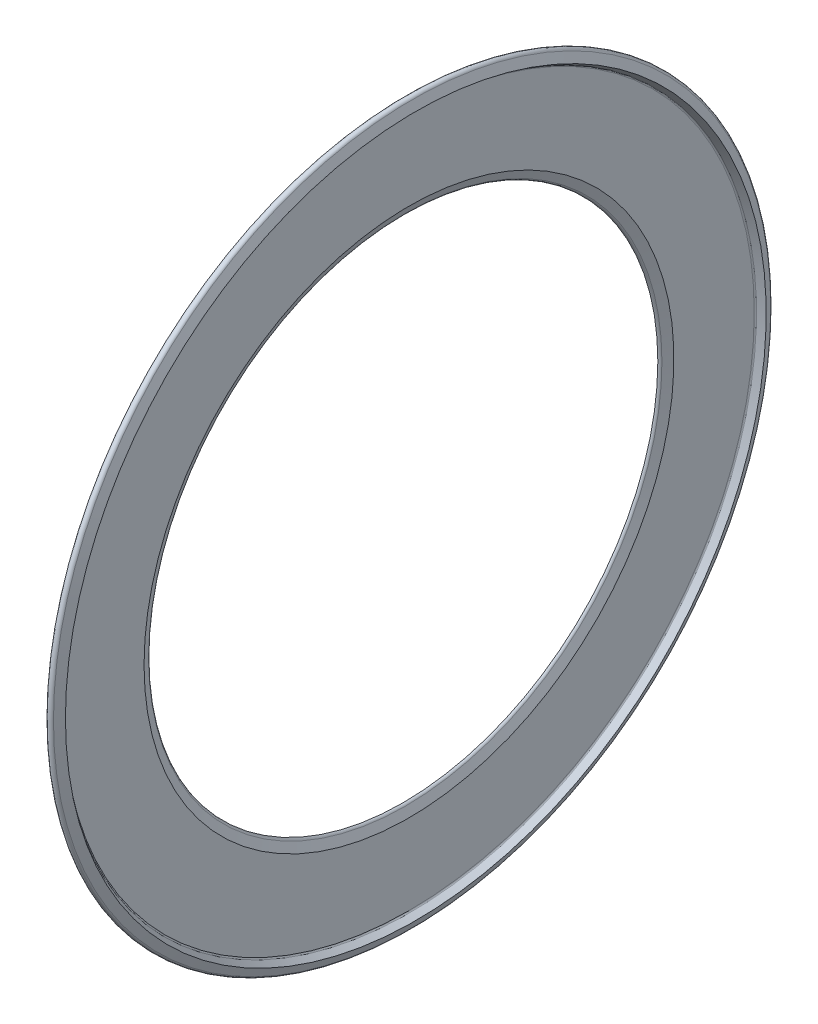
from build123d import *


with BuildPart() as part:
    # Esquisse1 → Base-R_volution (revolve)
    with BuildSketch(Plane.XY, mode=Mode.PRIVATE) as base_r_volution_sk:
        with BuildLine():
            Line((0.6, 15.5), (0.382287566, 15.017712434))
            ThreePointArc((0.382287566, 15.017712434), (0.329802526, 14.947844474), (0.252537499, 14.907023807))
            Line((0.252537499, 14.907023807), (0.252537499, 20.289030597))
            ThreePointArc((0.252537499, 20.289030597), (0.290597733, 20.480372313), (0.398984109, 20.642583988))
            Line((0.398984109, 20.642583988), (0.481799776, 20.725399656))
            Line((0.481799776, 20.725399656), (0.481799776, 21.061334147))
            ThreePointArc((0.481799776, 21.061334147), (0.65088111, 21.093419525), (0.782287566, 20.982287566))
            Line((0.782287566, 20.982287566), (1, 20.5))
            Line((1, 20.5), (0.647691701, 20.283772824))
            ThreePointArc((0.647691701, 20.283772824), (0.612733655, 20.247376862), (0.6, 20.198544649))
            Line((0.6, 20.198544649), (0.6, 15.5))
        make_face()
    revolve(base_r_volution_sk.sketch.rotate(Axis((-13, 0, 0), (1, 0, 0)), 90), axis=Axis((-13, 0, 0), (1, 0, 0)))


solid = part.part
